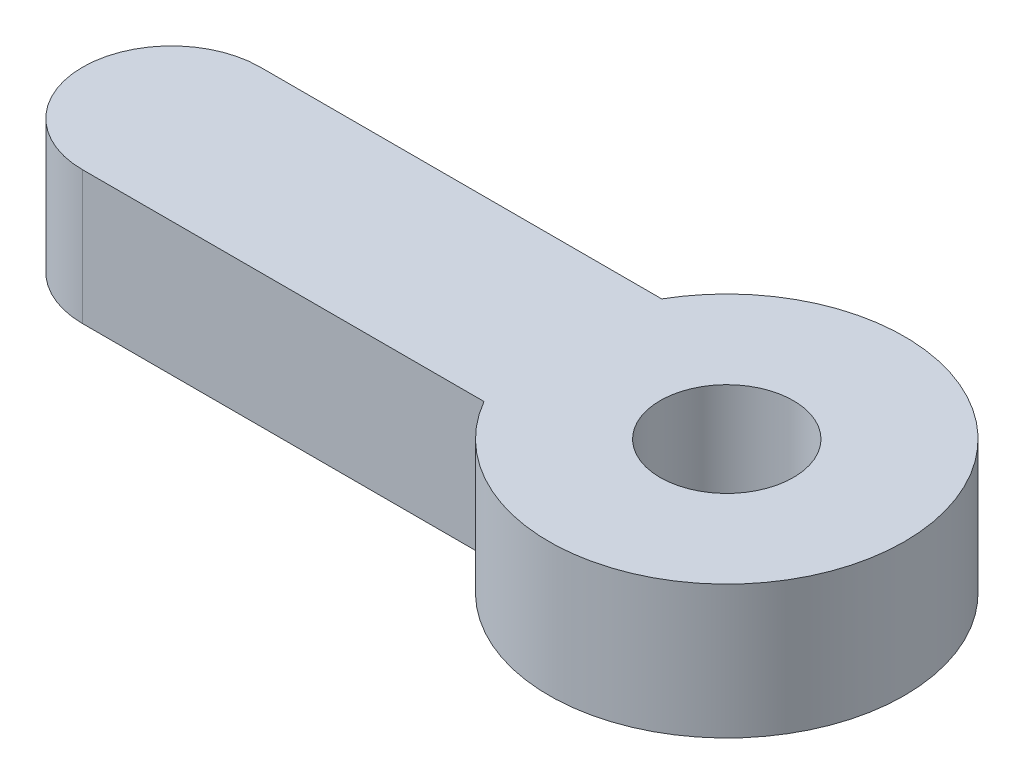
ISO-10303-21;
HEADER;
FILE_DESCRIPTION(('STEP AP214'),'2;1');
FILE_NAME('part.step','',(''),(''),'','','');
FILE_SCHEMA(('AUTOMOTIVE_DESIGN { 1 0 10303 214 1 1 1 1 }'));
ENDSEC;
DATA;
#1=APPLICATION_CONTEXT('core data for automotive mechanical design processes');
#2=APPLICATION_PROTOCOL_DEFINITION('international standard','automotive_design',2000,#1);
#3=PRODUCT_CONTEXT('',#1,'mechanical');
#4=PRODUCT('Part','Part','',(#3));
#5=PRODUCT_RELATED_PRODUCT_CATEGORY('part','',(#4));
#6=PRODUCT_DEFINITION_FORMATION('','',#4);
#7=PRODUCT_DEFINITION_CONTEXT('part definition',#1,'design');
#8=PRODUCT_DEFINITION('design','',#6,#7);
#9=PRODUCT_DEFINITION_SHAPE('','',#8);
#10=(LENGTH_UNIT() NAMED_UNIT(*) SI_UNIT(.MILLI.,.METRE.));
#11=(NAMED_UNIT(*) PLANE_ANGLE_UNIT() SI_UNIT($,.RADIAN.));
#12=(NAMED_UNIT(*) SI_UNIT($,.STERADIAN.) SOLID_ANGLE_UNIT());
#13=UNCERTAINTY_MEASURE_WITH_UNIT(LENGTH_MEASURE(1.E-05),#10,'distance_accuracy_value','');
#14=(GEOMETRIC_REPRESENTATION_CONTEXT(3) GLOBAL_UNCERTAINTY_ASSIGNED_CONTEXT((#13)) GLOBAL_UNIT_ASSIGNED_CONTEXT((#10,
#11,#12)) REPRESENTATION_CONTEXT('',''));
#15=CARTESIAN_POINT('',(0.,0.,0.));
#16=DIRECTION('',(0.,0.,1.));
#17=DIRECTION('',(1.,0.,0.));
#18=AXIS2_PLACEMENT_3D('',#15,#16,#17);
#19=CARTESIAN_POINT('',(25.,6.,0.));
#20=DIRECTION('',(0.,1.,0.));
#21=DIRECTION('',(0.,0.,1.));
#22=AXIS2_PLACEMENT_3D('',#19,#20,#21);
#23=PLANE('',#22);
#24=CARTESIAN_POINT('',(25.,6.,0.));
#25=DIRECTION('',(0.,1.,0.));
#26=DIRECTION('',(0.,0.,1.));
#27=AXIS2_PLACEMENT_3D('',#24,#25,#26);
#28=CIRCLE('',#27,8.);
#29=CARTESIAN_POINT('',(18.0717967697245,6.,4.));
#30=VERTEX_POINT('',#29);
#31=CARTESIAN_POINT('',(18.0717967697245,6.,-4.));
#32=VERTEX_POINT('',#31);
#33=EDGE_CURVE('E83',#30,#32,#28,.T.);
#34=ORIENTED_EDGE('',*,*,#33,.T.);
#35=DIRECTION('',(-1.,0.,0.));
#36=VECTOR('',#35,1.);
#37=CARTESIAN_POINT('',(0.,6.,-4.));
#38=LINE('',#37,#36);
#39=CARTESIAN_POINT('',(0.,6.,-4.));
#40=VERTEX_POINT('',#39);
#41=EDGE_CURVE('E78',#32,#40,#38,.T.);
#42=ORIENTED_EDGE('',*,*,#41,.T.);
#43=CARTESIAN_POINT('',(0.,6.,0.));
#44=DIRECTION('',(0.,1.,0.));
#45=DIRECTION('',(0.,0.,1.));
#46=AXIS2_PLACEMENT_3D('',#43,#44,#45);
#47=CIRCLE('',#46,4.);
#48=CARTESIAN_POINT('',(0.,6.,4.));
#49=VERTEX_POINT('',#48);
#50=EDGE_CURVE('E81',#40,#49,#47,.T.);
#51=ORIENTED_EDGE('',*,*,#50,.T.);
#52=DIRECTION('',(1.,0.,0.));
#53=VECTOR('',#52,1.);
#54=CARTESIAN_POINT('',(0.,6.,4.));
#55=LINE('',#54,#53);
#56=EDGE_CURVE('E48',#49,#30,#55,.T.);
#57=ORIENTED_EDGE('',*,*,#56,.T.);
#58=EDGE_LOOP('',(#34,#42,#51,#57));
#59=FACE_BOUND('',#58,.T.);
#60=CARTESIAN_POINT('',(25.,6.,0.));
#61=DIRECTION('',(0.,1.,0.));
#62=DIRECTION('',(0.,0.,1.));
#63=AXIS2_PLACEMENT_3D('',#60,#61,#62);
#64=CIRCLE('',#63,3.);
#65=CARTESIAN_POINT('',(25.,6.,3.));
#66=VERTEX_POINT('',#65);
#67=EDGE_CURVE('E98',#66,#66,#64,.T.);
#68=ORIENTED_EDGE('',*,*,#67,.F.);
#69=EDGE_LOOP('',(#68));
#70=FACE_BOUND('',#69,.T.);
#71=ADVANCED_FACE('F31',(#59,#70),#23,.T.);
#72=CARTESIAN_POINT('',(25.,0.,0.));
#73=DIRECTION('',(0.,1.,0.));
#74=DIRECTION('',(0.,0.,1.));
#75=AXIS2_PLACEMENT_3D('',#72,#73,#74);
#76=PLANE('',#75);
#77=CARTESIAN_POINT('',(25.,0.,0.));
#78=DIRECTION('',(0.,1.,0.));
#79=DIRECTION('',(0.,0.,1.));
#80=AXIS2_PLACEMENT_3D('',#77,#78,#79);
#81=CIRCLE('',#80,8.);
#82=CARTESIAN_POINT('',(18.0717967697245,0.,4.));
#83=VERTEX_POINT('',#82);
#84=CARTESIAN_POINT('',(18.0717967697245,0.,-4.));
#85=VERTEX_POINT('',#84);
#86=EDGE_CURVE('E95',#83,#85,#81,.T.);
#87=ORIENTED_EDGE('',*,*,#86,.F.);
#88=DIRECTION('',(1.,0.,0.));
#89=VECTOR('',#88,1.);
#90=CARTESIAN_POINT('',(0.,0.,4.));
#91=LINE('',#90,#89);
#92=CARTESIAN_POINT('',(0.,0.,4.));
#93=VERTEX_POINT('',#92);
#94=EDGE_CURVE('E71',#93,#83,#91,.T.);
#95=ORIENTED_EDGE('',*,*,#94,.F.);
#96=CARTESIAN_POINT('',(0.,0.,0.));
#97=DIRECTION('',(0.,1.,0.));
#98=DIRECTION('',(0.,0.,1.));
#99=AXIS2_PLACEMENT_3D('',#96,#97,#98);
#100=CIRCLE('',#99,4.);
#101=CARTESIAN_POINT('',(0.,0.,-4.));
#102=VERTEX_POINT('',#101);
#103=EDGE_CURVE('E65',#102,#93,#100,.T.);
#104=ORIENTED_EDGE('',*,*,#103,.F.);
#105=DIRECTION('',(-1.,0.,0.));
#106=VECTOR('',#105,1.);
#107=CARTESIAN_POINT('',(0.,0.,-4.));
#108=LINE('',#107,#106);
#109=EDGE_CURVE('E87',#85,#102,#108,.T.);
#110=ORIENTED_EDGE('',*,*,#109,.F.);
#111=EDGE_LOOP('',(#87,#95,#104,#110));
#112=FACE_BOUND('',#111,.T.);
#113=CARTESIAN_POINT('',(25.,0.,0.));
#114=DIRECTION('',(0.,1.,0.));
#115=DIRECTION('',(0.,0.,1.));
#116=AXIS2_PLACEMENT_3D('',#113,#114,#115);
#117=CIRCLE('',#116,3.);
#118=CARTESIAN_POINT('',(25.,0.,3.));
#119=VERTEX_POINT('',#118);
#120=EDGE_CURVE('E110',#119,#119,#117,.T.);
#121=ORIENTED_EDGE('',*,*,#120,.T.);
#122=EDGE_LOOP('',(#121));
#123=FACE_BOUND('',#122,.T.);
#124=ADVANCED_FACE('F106',(#112,#123),#76,.F.);
#125=CARTESIAN_POINT('',(25.,6.,0.));
#126=DIRECTION('',(0.,-1.,0.));
#127=DIRECTION('',(0.,0.,-1.));
#128=AXIS2_PLACEMENT_3D('',#125,#126,#127);
#129=CYLINDRICAL_SURFACE('',#128,8.);
#130=ORIENTED_EDGE('',*,*,#86,.T.);
#131=DIRECTION('',(0.,-1.,0.));
#132=VECTOR('',#131,1.);
#133=CARTESIAN_POINT('',(18.0717967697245,6.,-4.));
#134=LINE('',#133,#132);
#135=EDGE_CURVE('E11',#32,#85,#134,.T.);
#136=ORIENTED_EDGE('',*,*,#135,.F.);
#137=ORIENTED_EDGE('',*,*,#33,.F.);
#138=DIRECTION('',(0.,-1.,0.));
#139=VECTOR('',#138,1.);
#140=CARTESIAN_POINT('',(18.0717967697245,6.,4.));
#141=LINE('',#140,#139);
#142=EDGE_CURVE('E91',#30,#83,#141,.T.);
#143=ORIENTED_EDGE('',*,*,#142,.T.);
#144=EDGE_LOOP('',(#130,#136,#137,#143));
#145=FACE_BOUND('',#144,.T.);
#146=ADVANCED_FACE('F33',(#145),#129,.T.);
#147=CARTESIAN_POINT('',(0.,6.,-4.));
#148=DIRECTION('',(0.,0.,1.));
#149=DIRECTION('',(1.,0.,0.));
#150=AXIS2_PLACEMENT_3D('',#147,#148,#149);
#151=PLANE('',#150);
#152=ORIENTED_EDGE('',*,*,#109,.T.);
#153=DIRECTION('',(0.,-1.,0.));
#154=VECTOR('',#153,1.);
#155=CARTESIAN_POINT('',(0.,6.,-4.));
#156=LINE('',#155,#154);
#157=EDGE_CURVE('E40',#40,#102,#156,.T.);
#158=ORIENTED_EDGE('',*,*,#157,.F.);
#159=ORIENTED_EDGE('',*,*,#41,.F.);
#160=ORIENTED_EDGE('',*,*,#135,.T.);
#161=EDGE_LOOP('',(#152,#158,#159,#160));
#162=FACE_BOUND('',#161,.T.);
#163=ADVANCED_FACE('F86',(#162),#151,.F.);
#164=CARTESIAN_POINT('',(0.,6.,0.));
#165=DIRECTION('',(0.,-1.,0.));
#166=DIRECTION('',(0.,0.,-1.));
#167=AXIS2_PLACEMENT_3D('',#164,#165,#166);
#168=CYLINDRICAL_SURFACE('',#167,4.);
#169=ORIENTED_EDGE('',*,*,#103,.T.);
#170=DIRECTION('',(0.,-1.,0.));
#171=VECTOR('',#170,1.);
#172=CARTESIAN_POINT('',(0.,6.,4.));
#173=LINE('',#172,#171);
#174=EDGE_CURVE('E88',#49,#93,#173,.T.);
#175=ORIENTED_EDGE('',*,*,#174,.F.);
#176=ORIENTED_EDGE('',*,*,#50,.F.);
#177=ORIENTED_EDGE('',*,*,#157,.T.);
#178=EDGE_LOOP('',(#169,#175,#176,#177));
#179=FACE_BOUND('',#178,.T.);
#180=ADVANCED_FACE('F89',(#179),#168,.T.);
#181=CARTESIAN_POINT('',(0.,6.,4.));
#182=DIRECTION('',(0.,0.,-1.));
#183=DIRECTION('',(-1.,0.,0.));
#184=AXIS2_PLACEMENT_3D('',#181,#182,#183);
#185=PLANE('',#184);
#186=ORIENTED_EDGE('',*,*,#94,.T.);
#187=ORIENTED_EDGE('',*,*,#142,.F.);
#188=ORIENTED_EDGE('',*,*,#56,.F.);
#189=ORIENTED_EDGE('',*,*,#174,.T.);
#190=EDGE_LOOP('',(#186,#187,#188,#189));
#191=FACE_BOUND('',#190,.T.);
#192=ADVANCED_FACE('F103',(#191),#185,.F.);
#193=CARTESIAN_POINT('',(25.,6.,0.));
#194=DIRECTION('',(0.,-1.,0.));
#195=DIRECTION('',(0.,0.,-1.));
#196=AXIS2_PLACEMENT_3D('',#193,#194,#195);
#197=CYLINDRICAL_SURFACE('',#196,3.);
#198=ORIENTED_EDGE('',*,*,#67,.T.);
#199=EDGE_LOOP('',(#198));
#200=FACE_BOUND('',#199,.T.);
#201=ORIENTED_EDGE('',*,*,#120,.F.);
#202=EDGE_LOOP('',(#201));
#203=FACE_BOUND('',#202,.T.);
#204=ADVANCED_FACE('F116',(#200,#203),#197,.F.);
#205=CLOSED_SHELL('',(#71,#124,#146,#163,#180,#192,#204));
#206=MANIFOLD_SOLID_BREP('B2',#205);
#207=ADVANCED_BREP_SHAPE_REPRESENTATION('',(#18,#206),#14);
#208=SHAPE_DEFINITION_REPRESENTATION(#9,#207);
ENDSEC;
END-ISO-10303-21;
